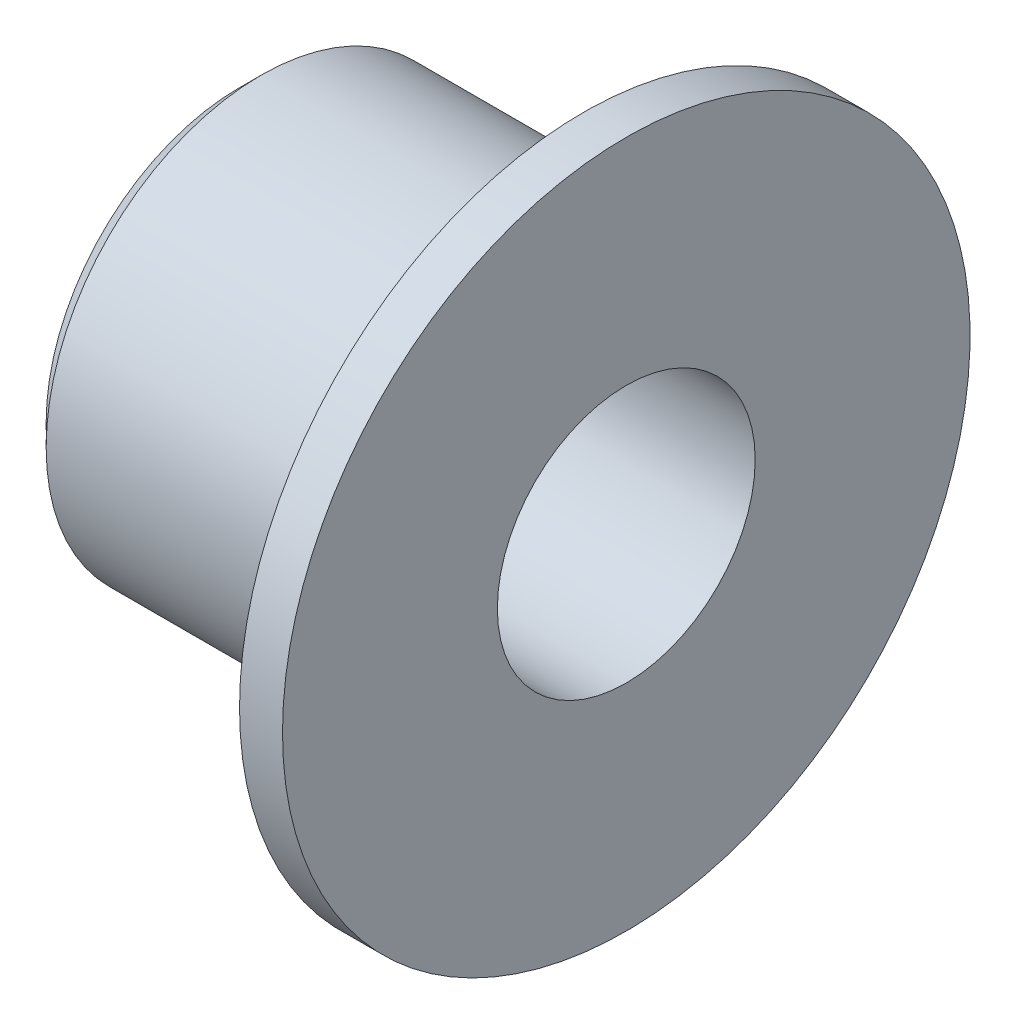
ISO-10303-21;
HEADER;
FILE_DESCRIPTION(('STEP AP214'),'2;1');
FILE_NAME('part.step','',(''),(''),'','','');
FILE_SCHEMA(('AUTOMOTIVE_DESIGN { 1 0 10303 214 1 1 1 1 }'));
ENDSEC;
DATA;
#1=APPLICATION_CONTEXT('core data for automotive mechanical design processes');
#2=APPLICATION_PROTOCOL_DEFINITION('international standard','automotive_design',2000,#1);
#3=PRODUCT_CONTEXT('',#1,'mechanical');
#4=PRODUCT('Part','Part','',(#3));
#5=PRODUCT_RELATED_PRODUCT_CATEGORY('part','',(#4));
#6=PRODUCT_DEFINITION_FORMATION('','',#4);
#7=PRODUCT_DEFINITION_CONTEXT('part definition',#1,'design');
#8=PRODUCT_DEFINITION('design','',#6,#7);
#9=PRODUCT_DEFINITION_SHAPE('','',#8);
#10=(LENGTH_UNIT() NAMED_UNIT(*) SI_UNIT(.MILLI.,.METRE.));
#11=(NAMED_UNIT(*) PLANE_ANGLE_UNIT() SI_UNIT($,.RADIAN.));
#12=(NAMED_UNIT(*) SI_UNIT($,.STERADIAN.) SOLID_ANGLE_UNIT());
#13=UNCERTAINTY_MEASURE_WITH_UNIT(LENGTH_MEASURE(1.E-05),#10,'distance_accuracy_value','');
#14=(GEOMETRIC_REPRESENTATION_CONTEXT(3) GLOBAL_UNCERTAINTY_ASSIGNED_CONTEXT((#13)) GLOBAL_UNIT_ASSIGNED_CONTEXT((#10,
#11,#12)) REPRESENTATION_CONTEXT('',''));
#15=CARTESIAN_POINT('',(0.,0.,0.));
#16=DIRECTION('',(0.,0.,1.));
#17=DIRECTION('',(1.,0.,0.));
#18=AXIS2_PLACEMENT_3D('',#15,#16,#17);
#19=CARTESIAN_POINT('',(0.,0.,0.));
#20=DIRECTION('',(-1.,0.,0.));
#21=DIRECTION('',(0.,0.,1.));
#22=AXIS2_PLACEMENT_3D('',#19,#20,#21);
#23=CYLINDRICAL_SURFACE('',#22,2.99999999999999);
#24=CARTESIAN_POINT('',(9.,0.,0.));
#25=DIRECTION('',(-1.,0.,0.));
#26=DIRECTION('',(0.,0.,1.));
#27=AXIS2_PLACEMENT_3D('',#24,#25,#26);
#28=CIRCLE('',#27,2.99999999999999);
#29=CARTESIAN_POINT('',(9.,0.,2.99999999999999));
#30=VERTEX_POINT('',#29);
#31=EDGE_CURVE('E53',#30,#30,#28,.T.);
#32=ORIENTED_EDGE('',*,*,#31,.F.);
#33=EDGE_LOOP('',(#32));
#34=FACE_BOUND('',#33,.T.);
#35=CARTESIAN_POINT('',(0.,0.,0.));
#36=DIRECTION('',(-1.,0.,0.));
#37=DIRECTION('',(0.,0.,1.));
#38=AXIS2_PLACEMENT_3D('',#35,#36,#37);
#39=CIRCLE('',#38,2.99999999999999);
#40=CARTESIAN_POINT('',(0.,0.,2.99999999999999));
#41=VERTEX_POINT('',#40);
#42=EDGE_CURVE('E38',#41,#41,#39,.T.);
#43=ORIENTED_EDGE('',*,*,#42,.T.);
#44=EDGE_LOOP('',(#43));
#45=FACE_BOUND('',#44,.T.);
#46=ADVANCED_FACE('F28',(#34,#45),#23,.F.);
#47=CARTESIAN_POINT('',(0.,2.99999999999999,0.));
#48=DIRECTION('',(1.,0.,0.));
#49=DIRECTION('',(0.,0.,-1.));
#50=AXIS2_PLACEMENT_3D('',#47,#48,#49);
#51=PLANE('',#50);
#52=CARTESIAN_POINT('',(0.,0.,0.));
#53=DIRECTION('',(1.,0.,0.));
#54=DIRECTION('',(0.,0.,-1.));
#55=AXIS2_PLACEMENT_3D('',#52,#53,#54);
#56=CIRCLE('',#55,4.49999999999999);
#57=CARTESIAN_POINT('',(0.,0.,-4.49999999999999));
#58=VERTEX_POINT('',#57);
#59=EDGE_CURVE('E34',#58,#58,#56,.F.);
#60=ORIENTED_EDGE('',*,*,#59,.T.);
#61=EDGE_LOOP('',(#60));
#62=FACE_BOUND('',#61,.T.);
#63=ORIENTED_EDGE('',*,*,#42,.F.);
#64=EDGE_LOOP('',(#63));
#65=FACE_BOUND('',#64,.T.);
#66=ADVANCED_FACE('F61',(#62,#65),#51,.F.);
#67=CARTESIAN_POINT('',(0.,0.,0.));
#68=DIRECTION('',(-1.,0.,0.));
#69=DIRECTION('',(0.,0.,1.));
#70=AXIS2_PLACEMENT_3D('',#67,#68,#69);
#71=CYLINDRICAL_SURFACE('',#70,5.);
#72=CARTESIAN_POINT('',(0.500000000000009,0.,0.));
#73=DIRECTION('',(1.,0.,0.));
#74=DIRECTION('',(0.,0.,-1.));
#75=AXIS2_PLACEMENT_3D('',#72,#73,#74);
#76=CIRCLE('',#75,5.);
#77=CARTESIAN_POINT('',(0.500000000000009,0.,-5.));
#78=VERTEX_POINT('',#77);
#79=EDGE_CURVE('E10',#78,#78,#76,.T.);
#80=ORIENTED_EDGE('',*,*,#79,.T.);
#81=EDGE_LOOP('',(#80));
#82=FACE_BOUND('',#81,.T.);
#83=CARTESIAN_POINT('',(8.,0.,0.));
#84=DIRECTION('',(-1.,0.,0.));
#85=DIRECTION('',(0.,0.,1.));
#86=AXIS2_PLACEMENT_3D('',#83,#84,#85);
#87=CIRCLE('',#86,5.);
#88=CARTESIAN_POINT('',(8.,0.,5.));
#89=VERTEX_POINT('',#88);
#90=EDGE_CURVE('E42',#89,#89,#87,.T.);
#91=ORIENTED_EDGE('',*,*,#90,.T.);
#92=EDGE_LOOP('',(#91));
#93=FACE_BOUND('',#92,.T.);
#94=ADVANCED_FACE('F65',(#82,#93),#71,.T.);
#95=CARTESIAN_POINT('',(8.,5.,0.));
#96=DIRECTION('',(1.,0.,0.));
#97=DIRECTION('',(0.,0.,-1.));
#98=AXIS2_PLACEMENT_3D('',#95,#96,#97);
#99=PLANE('',#98);
#100=ORIENTED_EDGE('',*,*,#90,.F.);
#101=EDGE_LOOP('',(#100));
#102=FACE_BOUND('',#101,.T.);
#103=CARTESIAN_POINT('',(8.,0.,0.));
#104=DIRECTION('',(-1.,0.,0.));
#105=DIRECTION('',(0.,0.,1.));
#106=AXIS2_PLACEMENT_3D('',#103,#104,#105);
#107=CIRCLE('',#106,8.);
#108=CARTESIAN_POINT('',(8.,0.,8.));
#109=VERTEX_POINT('',#108);
#110=EDGE_CURVE('E47',#109,#109,#107,.T.);
#111=ORIENTED_EDGE('',*,*,#110,.T.);
#112=EDGE_LOOP('',(#111));
#113=FACE_BOUND('',#112,.T.);
#114=ADVANCED_FACE('F69',(#102,#113),#99,.F.);
#115=CARTESIAN_POINT('',(0.,0.,0.));
#116=DIRECTION('',(-1.,0.,0.));
#117=DIRECTION('',(0.,0.,1.));
#118=AXIS2_PLACEMENT_3D('',#115,#116,#117);
#119=CYLINDRICAL_SURFACE('',#118,8.);
#120=ORIENTED_EDGE('',*,*,#110,.F.);
#121=EDGE_LOOP('',(#120));
#122=FACE_BOUND('',#121,.T.);
#123=CARTESIAN_POINT('',(9.,0.,0.));
#124=DIRECTION('',(-1.,0.,0.));
#125=DIRECTION('',(0.,0.,1.));
#126=AXIS2_PLACEMENT_3D('',#123,#124,#125);
#127=CIRCLE('',#126,8.);
#128=CARTESIAN_POINT('',(9.,0.,8.));
#129=VERTEX_POINT('',#128);
#130=EDGE_CURVE('E50',#129,#129,#127,.T.);
#131=ORIENTED_EDGE('',*,*,#130,.T.);
#132=EDGE_LOOP('',(#131));
#133=FACE_BOUND('',#132,.T.);
#134=ADVANCED_FACE('F74',(#122,#133),#119,.T.);
#135=CARTESIAN_POINT('',(9.,8.,0.));
#136=DIRECTION('',(-1.,0.,0.));
#137=DIRECTION('',(0.,0.,1.));
#138=AXIS2_PLACEMENT_3D('',#135,#136,#137);
#139=PLANE('',#138);
#140=ORIENTED_EDGE('',*,*,#130,.F.);
#141=EDGE_LOOP('',(#140));
#142=FACE_BOUND('',#141,.T.);
#143=ORIENTED_EDGE('',*,*,#31,.T.);
#144=EDGE_LOOP('',(#143));
#145=FACE_BOUND('',#144,.T.);
#146=ADVANCED_FACE('F57',(#142,#145),#139,.F.);
#147=CARTESIAN_POINT('',(0.,0.,0.));
#148=DIRECTION('',(1.,0.,0.));
#149=DIRECTION('',(0.,0.,-1.));
#150=AXIS2_PLACEMENT_3D('',#147,#148,#149);
#151=CONICAL_SURFACE('',#150,4.49999999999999,0.785398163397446);
#152=ORIENTED_EDGE('',*,*,#79,.F.);
#153=EDGE_LOOP('',(#152));
#154=FACE_BOUND('',#153,.T.);
#155=ORIENTED_EDGE('',*,*,#59,.F.);
#156=EDGE_LOOP('',(#155));
#157=FACE_BOUND('',#156,.T.);
#158=ADVANCED_FACE('F81',(#154,#157),#151,.T.);
#159=CLOSED_SHELL('',(#46,#66,#94,#114,#134,#146,#158));
#160=MANIFOLD_SOLID_BREP('B2',#159);
#161=ADVANCED_BREP_SHAPE_REPRESENTATION('',(#18,#160),#14);
#162=SHAPE_DEFINITION_REPRESENTATION(#9,#161);
ENDSEC;
END-ISO-10303-21;
